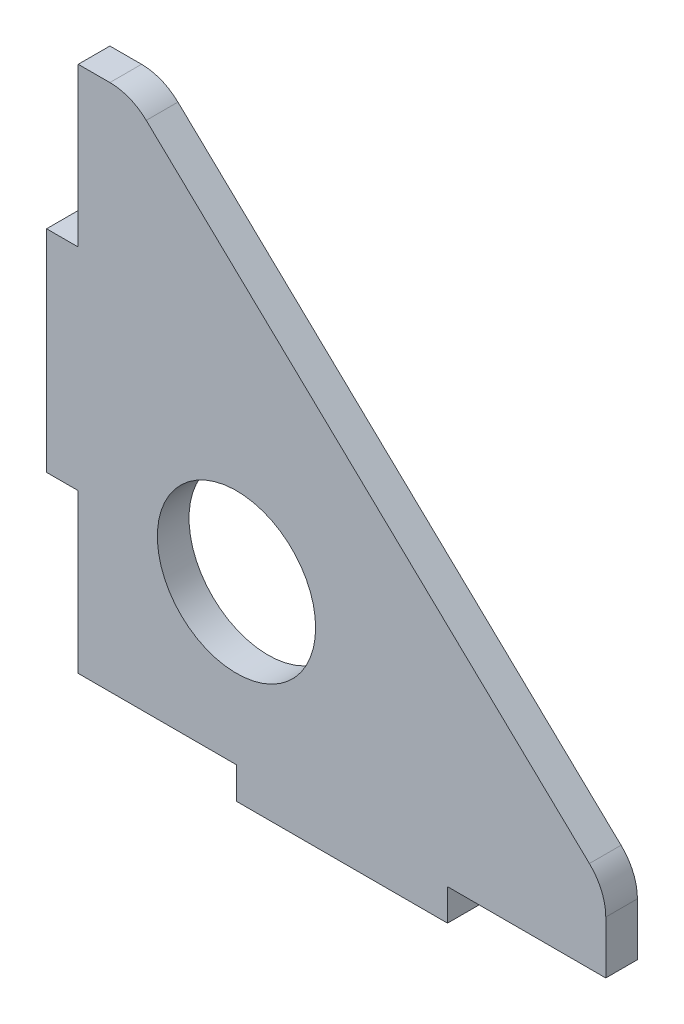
from build123d import *

# Parameters (mm, degrees)
ESQUISSE1_R        = 7.5
BOSS_EXTRU_1_DEPTH = 3


with BuildPart() as part:
    # Esquisse1 → Boss.-Extru.1 (new body)
    with BuildSketch(Plane.XY):
        with BuildLine():
            Line((0, 0), (0, 15))
            Line((0, 15), (-3, 15))
            Line((-3, 15), (-3, 35))
            Line((-3, 35), (0, 35))
            Line((0, 35), (0, 50))
            Line((0, 50), (3, 50))
            ThreePointArc((3, 50), (4.856953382, 49.642383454), (6.448275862, 48.620689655))
            Line((6.448275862, 48.620689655), (48.448275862, 8.620689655))
            ThreePointArc((48.448275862, 8.620689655), (49.59572515, 6.969596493), (50, 5))
            Line((50, 5), (50, 0))
            Line((50, 0), (35, 0))
            Line((35, 0), (35, -3))
            Line((35, -3), (15, -3))
            Line((15, -3), (15, 0))
            Line((15, 0), (0, 0))
        make_face()
        with Locations((15, 15)):
            Circle(ESQUISSE1_R, mode=Mode.SUBTRACT)
    extrude(amount=BOSS_EXTRU_1_DEPTH)


solid = part.part
